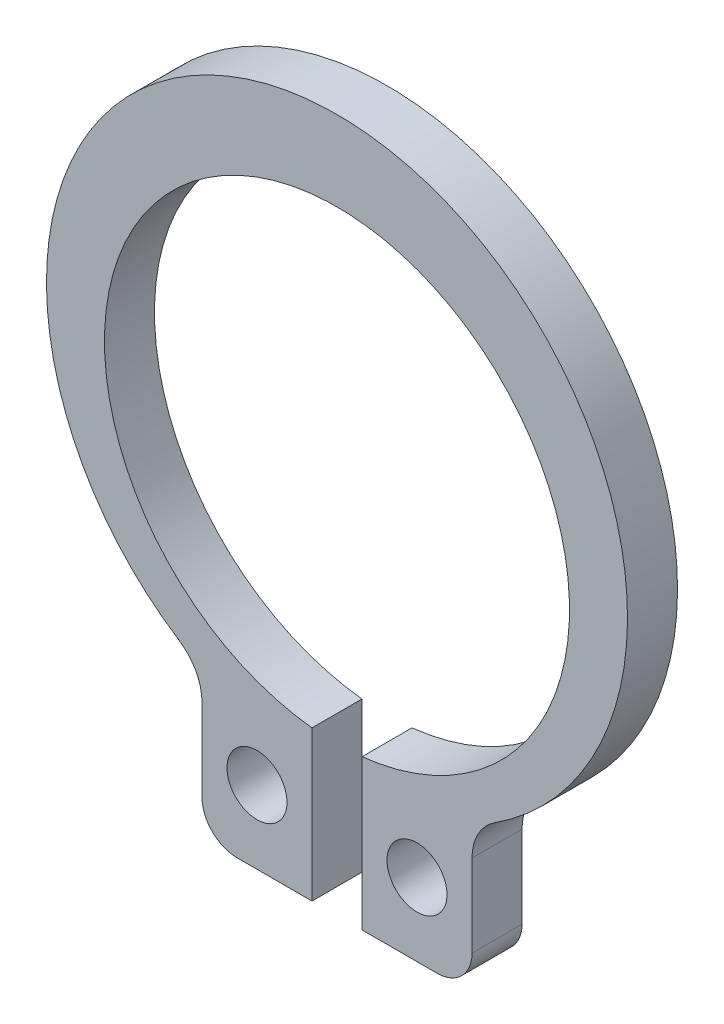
from build123d import *

# Parameters (mm, degrees)
BODYSKE_R      = 0.6
BASEBODY_DEPTH = 1
FILLET1_R      = 1
FILLET2_R      = 0.7


with BuildPart() as part:
    # BodySke → BaseBody (new body)
    with BuildSketch(Plane.XY):
        with BuildLine():
            Line((-0.5, -4.623040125), (-0.5, -7.623040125))
            Line((-0.5, -7.623040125), (-2.7, -7.623040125))
            Line((-2.7, -7.623040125), (-2.7, -4.704521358))
            ThreePointArc((-2.7, -4.704521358), (0, 6.25), (2.7, -4.704521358))
            Line((2.7, -4.704521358), (2.7, -7.623040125))
            Line((2.7, -7.623040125), (0.5, -7.623040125))
            Line((0.5, -7.623040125), (0.5, -4.623040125))
            ThreePointArc((0.5, -4.623040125), (0, 4.65), (-0.5, -4.623040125))
        make_face()
        with Locations((-1.6, -6.163780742)):
            Circle(BODYSKE_R, mode=Mode.SUBTRACT)
        with Locations(Location((1.6, -6.163780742, 0), (0, 0, 180))):
            Circle(BODYSKE_R, mode=Mode.SUBTRACT)
    extrude(amount=BASEBODY_DEPTH)

    # Fillet1
    fillet1_edges = [part.edges().sort_by_distance(p)[0] for p in [
        (-2.7, -4.704521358, 0.5),
        (2.7, -4.704521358, 0.5),
    ]]
    fillet(fillet1_edges, radius=FILLET1_R)

    # Fillet2
    fillet2_edges = [part.edges().sort_by_distance(p)[0] for p in [
        (-2.7, -7.623040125, 0.5),
        (2.7, -7.623040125, 0.5),
    ]]
    fillet(fillet2_edges, radius=FILLET2_R)


solid = part.part
